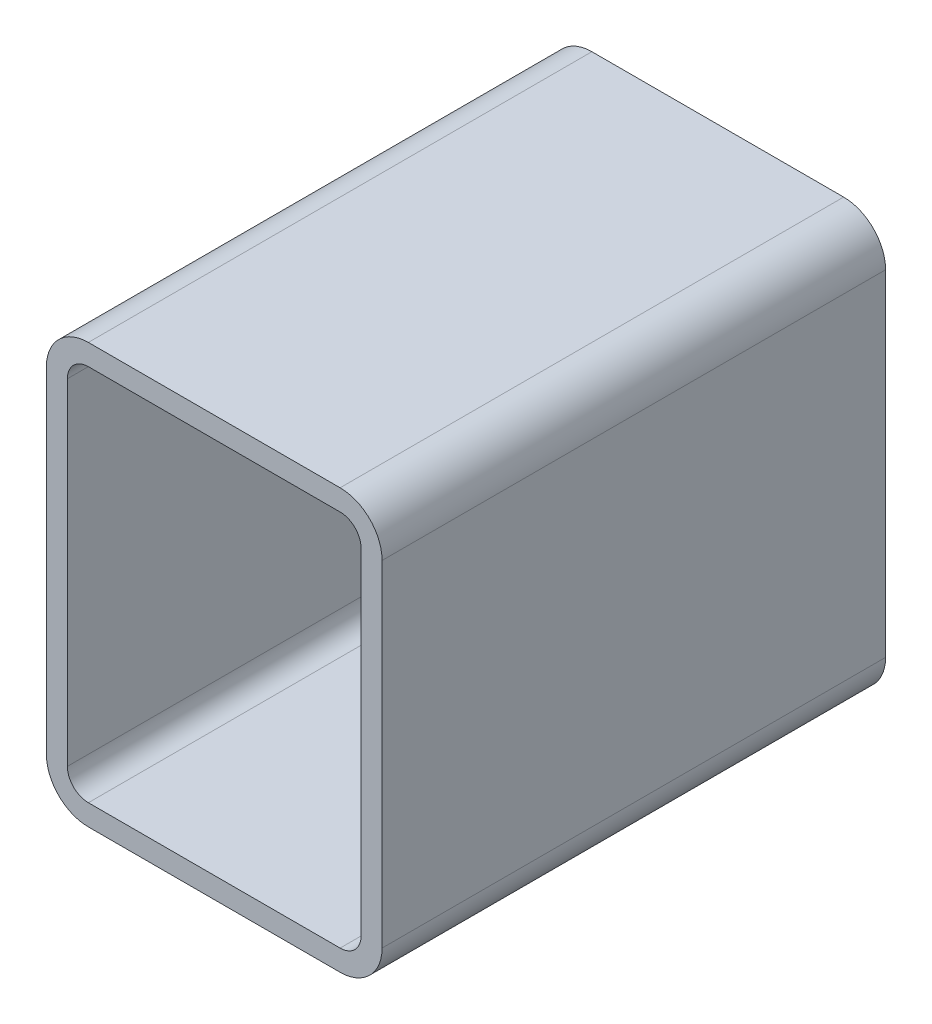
ISO-10303-21;
HEADER;
FILE_DESCRIPTION(('STEP AP214'),'2;1');
FILE_NAME('part.step','',(''),(''),'','','');
FILE_SCHEMA(('AUTOMOTIVE_DESIGN { 1 0 10303 214 1 1 1 1 }'));
ENDSEC;
DATA;
#1=APPLICATION_CONTEXT('core data for automotive mechanical design processes');
#2=APPLICATION_PROTOCOL_DEFINITION('international standard','automotive_design',2000,#1);
#3=PRODUCT_CONTEXT('',#1,'mechanical');
#4=PRODUCT('Part','Part','',(#3));
#5=PRODUCT_RELATED_PRODUCT_CATEGORY('part','',(#4));
#6=PRODUCT_DEFINITION_FORMATION('','',#4);
#7=PRODUCT_DEFINITION_CONTEXT('part definition',#1,'design');
#8=PRODUCT_DEFINITION('design','',#6,#7);
#9=PRODUCT_DEFINITION_SHAPE('','',#8);
#10=(LENGTH_UNIT() NAMED_UNIT(*) SI_UNIT(.MILLI.,.METRE.));
#11=(NAMED_UNIT(*) PLANE_ANGLE_UNIT() SI_UNIT($,.RADIAN.));
#12=(NAMED_UNIT(*) SI_UNIT($,.STERADIAN.) SOLID_ANGLE_UNIT());
#13=UNCERTAINTY_MEASURE_WITH_UNIT(LENGTH_MEASURE(1.E-05),#10,'distance_accuracy_value','');
#14=(GEOMETRIC_REPRESENTATION_CONTEXT(3) GLOBAL_UNCERTAINTY_ASSIGNED_CONTEXT((#13)) GLOBAL_UNIT_ASSIGNED_CONTEXT((#10,
#11,#12)) REPRESENTATION_CONTEXT('',''));
#15=CARTESIAN_POINT('',(0.,0.,0.));
#16=DIRECTION('',(0.,0.,1.));
#17=DIRECTION('',(1.,0.,0.));
#18=AXIS2_PLACEMENT_3D('',#15,#16,#17);
#19=CARTESIAN_POINT('',(179.190940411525,230.520313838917,304.8));
#20=DIRECTION('',(0.,0.,1.));
#21=DIRECTION('',(1.,0.,0.));
#22=AXIS2_PLACEMENT_3D('',#19,#20,#21);
#23=PLANE('',#22);
#24=CARTESIAN_POINT('',(179.190940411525,230.520313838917,304.8));
#25=DIRECTION('',(0.,0.,1.));
#26=DIRECTION('',(1.,0.,0.));
#27=AXIS2_PLACEMENT_3D('',#24,#25,#26);
#28=CIRCLE('',#27,25.4);
#29=CARTESIAN_POINT('',(204.590940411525,230.520313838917,304.8));
#30=VERTEX_POINT('',#29);
#31=CARTESIAN_POINT('',(179.190940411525,255.920313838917,304.8));
#32=VERTEX_POINT('',#31);
#33=EDGE_CURVE('E211',#30,#32,#28,.T.);
#34=ORIENTED_EDGE('',*,*,#33,.T.);
#35=DIRECTION('',(-1.,0.,0.));
#36=VECTOR('',#35,1.);
#37=CARTESIAN_POINT('',(26.7909404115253,255.920313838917,304.8));
#38=LINE('',#37,#36);
#39=CARTESIAN_POINT('',(26.7909404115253,255.920313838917,304.8));
#40=VERTEX_POINT('',#39);
#41=EDGE_CURVE('E214',#32,#40,#38,.T.);
#42=ORIENTED_EDGE('',*,*,#41,.T.);
#43=CARTESIAN_POINT('',(26.7909404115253,230.520313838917,304.8));
#44=DIRECTION('',(0.,0.,1.));
#45=DIRECTION('',(1.,0.,0.));
#46=AXIS2_PLACEMENT_3D('',#43,#44,#45);
#47=CIRCLE('',#46,25.4);
#48=CARTESIAN_POINT('',(1.3909404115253,230.520313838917,304.8));
#49=VERTEX_POINT('',#48);
#50=EDGE_CURVE('E217',#40,#49,#47,.T.);
#51=ORIENTED_EDGE('',*,*,#50,.T.);
#52=DIRECTION('',(0.,-1.,0.));
#53=VECTOR('',#52,1.);
#54=CARTESIAN_POINT('',(1.3909404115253,27.3203138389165,304.8));
#55=LINE('',#54,#53);
#56=CARTESIAN_POINT('',(1.3909404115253,27.3203138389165,304.8));
#57=VERTEX_POINT('',#56);
#58=EDGE_CURVE('E219',#49,#57,#55,.T.);
#59=ORIENTED_EDGE('',*,*,#58,.T.);
#60=CARTESIAN_POINT('',(26.7909404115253,27.3203138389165,304.8));
#61=DIRECTION('',(0.,0.,1.));
#62=DIRECTION('',(1.,0.,0.));
#63=AXIS2_PLACEMENT_3D('',#60,#61,#62);
#64=CIRCLE('',#63,25.4);
#65=CARTESIAN_POINT('',(26.7909404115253,1.92031383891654,304.8));
#66=VERTEX_POINT('',#65);
#67=EDGE_CURVE('E221',#57,#66,#64,.T.);
#68=ORIENTED_EDGE('',*,*,#67,.T.);
#69=DIRECTION('',(1.,0.,0.));
#70=VECTOR('',#69,1.);
#71=CARTESIAN_POINT('',(179.190940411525,1.92031383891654,304.8));
#72=LINE('',#71,#70);
#73=CARTESIAN_POINT('',(179.190940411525,1.92031383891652,304.8));
#74=VERTEX_POINT('',#73);
#75=EDGE_CURVE('E223',#66,#74,#72,.T.);
#76=ORIENTED_EDGE('',*,*,#75,.T.);
#77=CARTESIAN_POINT('',(179.190940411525,27.3203138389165,304.8));
#78=DIRECTION('',(0.,0.,1.));
#79=DIRECTION('',(1.,0.,0.));
#80=AXIS2_PLACEMENT_3D('',#77,#78,#79);
#81=CIRCLE('',#80,25.4);
#82=CARTESIAN_POINT('',(204.590940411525,27.3203138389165,304.8));
#83=VERTEX_POINT('',#82);
#84=EDGE_CURVE('E225',#74,#83,#81,.T.);
#85=ORIENTED_EDGE('',*,*,#84,.T.);
#86=DIRECTION('',(0.,1.,0.));
#87=VECTOR('',#86,1.);
#88=CARTESIAN_POINT('',(204.590940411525,230.520313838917,304.8));
#89=LINE('',#88,#87);
#90=EDGE_CURVE('E227',#83,#30,#89,.T.);
#91=ORIENTED_EDGE('',*,*,#90,.T.);
#92=EDGE_LOOP('',(#34,#42,#51,#59,#68,#76,#85,#91));
#93=FACE_BOUND('',#92,.T.);
#94=DIRECTION('',(0.,-1.,0.));
#95=VECTOR('',#94,1.);
#96=CARTESIAN_POINT('',(14.0909404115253,27.3203138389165,304.8));
#97=LINE('',#96,#95);
#98=CARTESIAN_POINT('',(14.0909404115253,230.520313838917,304.8));
#99=VERTEX_POINT('',#98);
#100=CARTESIAN_POINT('',(14.0909404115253,27.3203138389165,304.8));
#101=VERTEX_POINT('',#100);
#102=EDGE_CURVE('E154',#99,#101,#97,.T.);
#103=ORIENTED_EDGE('',*,*,#102,.F.);
#104=CARTESIAN_POINT('',(26.7909404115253,230.520313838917,304.8));
#105=DIRECTION('',(0.,0.,1.));
#106=DIRECTION('',(1.,0.,0.));
#107=AXIS2_PLACEMENT_3D('',#104,#105,#106);
#108=CIRCLE('',#107,12.7);
#109=CARTESIAN_POINT('',(26.7909404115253,243.220313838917,304.8));
#110=VERTEX_POINT('',#109);
#111=EDGE_CURVE('E146',#110,#99,#108,.T.);
#112=ORIENTED_EDGE('',*,*,#111,.F.);
#113=DIRECTION('',(-1.,0.,0.));
#114=VECTOR('',#113,1.);
#115=CARTESIAN_POINT('',(26.7909404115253,243.220313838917,304.8));
#116=LINE('',#115,#114);
#117=CARTESIAN_POINT('',(179.190940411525,243.220313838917,304.8));
#118=VERTEX_POINT('',#117);
#119=EDGE_CURVE('E179',#118,#110,#116,.T.);
#120=ORIENTED_EDGE('',*,*,#119,.F.);
#121=CARTESIAN_POINT('',(179.190940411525,230.520313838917,304.8));
#122=DIRECTION('',(0.,0.,1.));
#123=DIRECTION('',(1.,0.,0.));
#124=AXIS2_PLACEMENT_3D('',#121,#122,#123);
#125=CIRCLE('',#124,12.7);
#126=CARTESIAN_POINT('',(191.890940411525,230.520313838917,304.8));
#127=VERTEX_POINT('',#126);
#128=EDGE_CURVE('E177',#127,#118,#125,.T.);
#129=ORIENTED_EDGE('',*,*,#128,.F.);
#130=DIRECTION('',(0.,1.,0.));
#131=VECTOR('',#130,1.);
#132=CARTESIAN_POINT('',(191.890940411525,230.520313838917,304.8));
#133=LINE('',#132,#131);
#134=CARTESIAN_POINT('',(191.890940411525,27.3203138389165,304.8));
#135=VERTEX_POINT('',#134);
#136=EDGE_CURVE('E175',#135,#127,#133,.T.);
#137=ORIENTED_EDGE('',*,*,#136,.F.);
#138=CARTESIAN_POINT('',(179.190940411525,27.3203138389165,304.8));
#139=DIRECTION('',(0.,0.,1.));
#140=DIRECTION('',(1.,0.,0.));
#141=AXIS2_PLACEMENT_3D('',#138,#139,#140);
#142=CIRCLE('',#141,12.7);
#143=CARTESIAN_POINT('',(179.190940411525,14.6203138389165,304.8));
#144=VERTEX_POINT('',#143);
#145=EDGE_CURVE('E173',#144,#135,#142,.T.);
#146=ORIENTED_EDGE('',*,*,#145,.F.);
#147=DIRECTION('',(1.,0.,0.));
#148=VECTOR('',#147,1.);
#149=CARTESIAN_POINT('',(179.190940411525,14.6203138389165,304.8));
#150=LINE('',#149,#148);
#151=CARTESIAN_POINT('',(26.7909404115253,14.6203138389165,304.8));
#152=VERTEX_POINT('',#151);
#153=EDGE_CURVE('E169',#152,#144,#150,.T.);
#154=ORIENTED_EDGE('',*,*,#153,.F.);
#155=CARTESIAN_POINT('',(26.7909404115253,27.3203138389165,304.8));
#156=DIRECTION('',(0.,0.,1.));
#157=DIRECTION('',(1.,0.,0.));
#158=AXIS2_PLACEMENT_3D('',#155,#156,#157);
#159=CIRCLE('',#158,12.7);
#160=EDGE_CURVE('E167',#101,#152,#159,.T.);
#161=ORIENTED_EDGE('',*,*,#160,.F.);
#162=EDGE_LOOP('',(#103,#112,#120,#129,#137,#146,#154,#161));
#163=FACE_BOUND('',#162,.T.);
#164=ADVANCED_FACE('F33',(#93,#163),#23,.T.);
#165=CARTESIAN_POINT('',(179.190940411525,230.520313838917,0.));
#166=DIRECTION('',(0.,0.,1.));
#167=DIRECTION('',(1.,0.,0.));
#168=AXIS2_PLACEMENT_3D('',#165,#166,#167);
#169=PLANE('',#168);
#170=CARTESIAN_POINT('',(179.190940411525,230.520313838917,0.));
#171=DIRECTION('',(0.,0.,1.));
#172=DIRECTION('',(1.,0.,0.));
#173=AXIS2_PLACEMENT_3D('',#170,#171,#172);
#174=CIRCLE('',#173,25.4);
#175=CARTESIAN_POINT('',(204.590940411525,230.520313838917,0.));
#176=VERTEX_POINT('',#175);
#177=CARTESIAN_POINT('',(179.190940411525,255.920313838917,0.));
#178=VERTEX_POINT('',#177);
#179=EDGE_CURVE('E162',#176,#178,#174,.T.);
#180=ORIENTED_EDGE('',*,*,#179,.F.);
#181=DIRECTION('',(0.,1.,0.));
#182=VECTOR('',#181,1.);
#183=CARTESIAN_POINT('',(204.590940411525,230.520313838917,0.));
#184=LINE('',#183,#182);
#185=CARTESIAN_POINT('',(204.590940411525,27.3203138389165,0.));
#186=VERTEX_POINT('',#185);
#187=EDGE_CURVE('E215',#186,#176,#184,.T.);
#188=ORIENTED_EDGE('',*,*,#187,.F.);
#189=CARTESIAN_POINT('',(179.190940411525,27.3203138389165,0.));
#190=DIRECTION('',(0.,0.,1.));
#191=DIRECTION('',(1.,0.,0.));
#192=AXIS2_PLACEMENT_3D('',#189,#190,#191);
#193=CIRCLE('',#192,25.4);
#194=CARTESIAN_POINT('',(179.190940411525,1.92031383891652,0.));
#195=VERTEX_POINT('',#194);
#196=EDGE_CURVE('E242',#195,#186,#193,.T.);
#197=ORIENTED_EDGE('',*,*,#196,.F.);
#198=DIRECTION('',(1.,0.,0.));
#199=VECTOR('',#198,1.);
#200=CARTESIAN_POINT('',(179.190940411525,1.92031383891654,0.));
#201=LINE('',#200,#199);
#202=CARTESIAN_POINT('',(26.7909404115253,1.92031383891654,0.));
#203=VERTEX_POINT('',#202);
#204=EDGE_CURVE('E240',#203,#195,#201,.T.);
#205=ORIENTED_EDGE('',*,*,#204,.F.);
#206=CARTESIAN_POINT('',(26.7909404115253,27.3203138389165,0.));
#207=DIRECTION('',(0.,0.,1.));
#208=DIRECTION('',(1.,0.,0.));
#209=AXIS2_PLACEMENT_3D('',#206,#207,#208);
#210=CIRCLE('',#209,25.4);
#211=CARTESIAN_POINT('',(1.3909404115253,27.3203138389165,0.));
#212=VERTEX_POINT('',#211);
#213=EDGE_CURVE('E238',#212,#203,#210,.T.);
#214=ORIENTED_EDGE('',*,*,#213,.F.);
#215=DIRECTION('',(0.,-1.,0.));
#216=VECTOR('',#215,1.);
#217=CARTESIAN_POINT('',(1.3909404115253,27.3203138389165,0.));
#218=LINE('',#217,#216);
#219=CARTESIAN_POINT('',(1.3909404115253,230.520313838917,0.));
#220=VERTEX_POINT('',#219);
#221=EDGE_CURVE('E236',#220,#212,#218,.T.);
#222=ORIENTED_EDGE('',*,*,#221,.F.);
#223=CARTESIAN_POINT('',(26.7909404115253,230.520313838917,0.));
#224=DIRECTION('',(0.,0.,1.));
#225=DIRECTION('',(1.,0.,0.));
#226=AXIS2_PLACEMENT_3D('',#223,#224,#225);
#227=CIRCLE('',#226,25.4);
#228=CARTESIAN_POINT('',(26.7909404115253,255.920313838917,0.));
#229=VERTEX_POINT('',#228);
#230=EDGE_CURVE('E234',#229,#220,#227,.T.);
#231=ORIENTED_EDGE('',*,*,#230,.F.);
#232=DIRECTION('',(-1.,0.,0.));
#233=VECTOR('',#232,1.);
#234=CARTESIAN_POINT('',(26.7909404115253,255.920313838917,0.));
#235=LINE('',#234,#233);
#236=EDGE_CURVE('E232',#178,#229,#235,.T.);
#237=ORIENTED_EDGE('',*,*,#236,.F.);
#238=EDGE_LOOP('',(#180,#188,#197,#205,#214,#222,#231,#237));
#239=FACE_BOUND('',#238,.T.);
#240=CARTESIAN_POINT('',(26.7909404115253,230.520313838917,0.));
#241=DIRECTION('',(0.,0.,1.));
#242=DIRECTION('',(1.,0.,0.));
#243=AXIS2_PLACEMENT_3D('',#240,#241,#242);
#244=CIRCLE('',#243,12.7);
#245=CARTESIAN_POINT('',(26.7909404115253,243.220313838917,0.));
#246=VERTEX_POINT('',#245);
#247=CARTESIAN_POINT('',(14.0909404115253,230.520313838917,0.));
#248=VERTEX_POINT('',#247);
#249=EDGE_CURVE('E56',#246,#248,#244,.T.);
#250=ORIENTED_EDGE('',*,*,#249,.T.);
#251=DIRECTION('',(0.,-1.,0.));
#252=VECTOR('',#251,1.);
#253=CARTESIAN_POINT('',(14.0909404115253,27.3203138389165,0.));
#254=LINE('',#253,#252);
#255=CARTESIAN_POINT('',(14.0909404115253,27.3203138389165,0.));
#256=VERTEX_POINT('',#255);
#257=EDGE_CURVE('E161',#248,#256,#254,.T.);
#258=ORIENTED_EDGE('',*,*,#257,.T.);
#259=CARTESIAN_POINT('',(26.7909404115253,27.3203138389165,0.));
#260=DIRECTION('',(0.,0.,1.));
#261=DIRECTION('',(1.,0.,0.));
#262=AXIS2_PLACEMENT_3D('',#259,#260,#261);
#263=CIRCLE('',#262,12.7);
#264=CARTESIAN_POINT('',(26.7909404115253,14.6203138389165,0.));
#265=VERTEX_POINT('',#264);
#266=EDGE_CURVE('E183',#256,#265,#263,.T.);
#267=ORIENTED_EDGE('',*,*,#266,.T.);
#268=DIRECTION('',(1.,0.,0.));
#269=VECTOR('',#268,1.);
#270=CARTESIAN_POINT('',(179.190940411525,14.6203138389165,0.));
#271=LINE('',#270,#269);
#272=CARTESIAN_POINT('',(179.190940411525,14.6203138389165,0.));
#273=VERTEX_POINT('',#272);
#274=EDGE_CURVE('E186',#265,#273,#271,.T.);
#275=ORIENTED_EDGE('',*,*,#274,.T.);
#276=CARTESIAN_POINT('',(179.190940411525,27.3203138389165,0.));
#277=DIRECTION('',(0.,0.,1.));
#278=DIRECTION('',(1.,0.,0.));
#279=AXIS2_PLACEMENT_3D('',#276,#277,#278);
#280=CIRCLE('',#279,12.7);
#281=CARTESIAN_POINT('',(191.890940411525,27.3203138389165,0.));
#282=VERTEX_POINT('',#281);
#283=EDGE_CURVE('E189',#273,#282,#280,.T.);
#284=ORIENTED_EDGE('',*,*,#283,.T.);
#285=DIRECTION('',(0.,1.,0.));
#286=VECTOR('',#285,1.);
#287=CARTESIAN_POINT('',(191.890940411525,230.520313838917,0.));
#288=LINE('',#287,#286);
#289=CARTESIAN_POINT('',(191.890940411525,230.520313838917,0.));
#290=VERTEX_POINT('',#289);
#291=EDGE_CURVE('E192',#282,#290,#288,.T.);
#292=ORIENTED_EDGE('',*,*,#291,.T.);
#293=CARTESIAN_POINT('',(179.190940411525,230.520313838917,0.));
#294=DIRECTION('',(0.,0.,1.));
#295=DIRECTION('',(1.,0.,0.));
#296=AXIS2_PLACEMENT_3D('',#293,#294,#295);
#297=CIRCLE('',#296,12.7);
#298=CARTESIAN_POINT('',(179.190940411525,243.220313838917,0.));
#299=VERTEX_POINT('',#298);
#300=EDGE_CURVE('E195',#290,#299,#297,.T.);
#301=ORIENTED_EDGE('',*,*,#300,.T.);
#302=DIRECTION('',(-1.,0.,0.));
#303=VECTOR('',#302,1.);
#304=CARTESIAN_POINT('',(26.7909404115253,243.220313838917,0.));
#305=LINE('',#304,#303);
#306=EDGE_CURVE('E155',#299,#246,#305,.T.);
#307=ORIENTED_EDGE('',*,*,#306,.T.);
#308=EDGE_LOOP('',(#250,#258,#267,#275,#284,#292,#301,#307));
#309=FACE_BOUND('',#308,.T.);
#310=ADVANCED_FACE('F272',(#239,#309),#169,.F.);
#311=CARTESIAN_POINT('',(179.190940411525,230.520313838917,304.8));
#312=DIRECTION('',(0.,0.,-1.));
#313=DIRECTION('',(-1.,0.,0.));
#314=AXIS2_PLACEMENT_3D('',#311,#312,#313);
#315=CYLINDRICAL_SURFACE('',#314,25.4);
#316=ORIENTED_EDGE('',*,*,#179,.T.);
#317=DIRECTION('',(0.,0.,-1.));
#318=VECTOR('',#317,1.);
#319=CARTESIAN_POINT('',(179.190940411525,255.920313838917,304.8));
#320=LINE('',#319,#318);
#321=EDGE_CURVE('E11',#32,#178,#320,.T.);
#322=ORIENTED_EDGE('',*,*,#321,.F.);
#323=ORIENTED_EDGE('',*,*,#33,.F.);
#324=DIRECTION('',(0.,0.,-1.));
#325=VECTOR('',#324,1.);
#326=CARTESIAN_POINT('',(204.590940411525,230.520313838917,304.8));
#327=LINE('',#326,#325);
#328=EDGE_CURVE('E229',#30,#176,#327,.T.);
#329=ORIENTED_EDGE('',*,*,#328,.T.);
#330=EDGE_LOOP('',(#316,#322,#323,#329));
#331=FACE_BOUND('',#330,.T.);
#332=ADVANCED_FACE('F35',(#331),#315,.T.);
#333=CARTESIAN_POINT('',(26.7909404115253,255.920313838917,304.8));
#334=DIRECTION('',(0.,-1.,0.));
#335=DIRECTION('',(0.,0.,-1.));
#336=AXIS2_PLACEMENT_3D('',#333,#334,#335);
#337=PLANE('',#336);
#338=ORIENTED_EDGE('',*,*,#236,.T.);
#339=DIRECTION('',(0.,0.,-1.));
#340=VECTOR('',#339,1.);
#341=CARTESIAN_POINT('',(26.7909404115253,255.920313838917,304.8));
#342=LINE('',#341,#340);
#343=EDGE_CURVE('E41',#40,#229,#342,.T.);
#344=ORIENTED_EDGE('',*,*,#343,.F.);
#345=ORIENTED_EDGE('',*,*,#41,.F.);
#346=ORIENTED_EDGE('',*,*,#321,.T.);
#347=EDGE_LOOP('',(#338,#344,#345,#346));
#348=FACE_BOUND('',#347,.T.);
#349=ADVANCED_FACE('F289',(#348),#337,.F.);
#350=CARTESIAN_POINT('',(26.7909404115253,230.520313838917,304.8));
#351=DIRECTION('',(0.,0.,-1.));
#352=DIRECTION('',(-1.,0.,0.));
#353=AXIS2_PLACEMENT_3D('',#350,#351,#352);
#354=CYLINDRICAL_SURFACE('',#353,25.4);
#355=ORIENTED_EDGE('',*,*,#230,.T.);
#356=DIRECTION('',(0.,0.,-1.));
#357=VECTOR('',#356,1.);
#358=CARTESIAN_POINT('',(1.3909404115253,230.520313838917,304.8));
#359=LINE('',#358,#357);
#360=EDGE_CURVE('E259',#49,#220,#359,.T.);
#361=ORIENTED_EDGE('',*,*,#360,.F.);
#362=ORIENTED_EDGE('',*,*,#50,.F.);
#363=ORIENTED_EDGE('',*,*,#343,.T.);
#364=EDGE_LOOP('',(#355,#361,#362,#363));
#365=FACE_BOUND('',#364,.T.);
#366=ADVANCED_FACE('F266',(#365),#354,.T.);
#367=CARTESIAN_POINT('',(1.3909404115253,27.3203138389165,304.8));
#368=DIRECTION('',(1.,0.,0.));
#369=DIRECTION('',(0.,0.,-1.));
#370=AXIS2_PLACEMENT_3D('',#367,#368,#369);
#371=PLANE('',#370);
#372=ORIENTED_EDGE('',*,*,#221,.T.);
#373=DIRECTION('',(0.,0.,-1.));
#374=VECTOR('',#373,1.);
#375=CARTESIAN_POINT('',(1.3909404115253,27.3203138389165,304.8));
#376=LINE('',#375,#374);
#377=EDGE_CURVE('E256',#57,#212,#376,.T.);
#378=ORIENTED_EDGE('',*,*,#377,.F.);
#379=ORIENTED_EDGE('',*,*,#58,.F.);
#380=ORIENTED_EDGE('',*,*,#360,.T.);
#381=EDGE_LOOP('',(#372,#378,#379,#380));
#382=FACE_BOUND('',#381,.T.);
#383=ADVANCED_FACE('F278',(#382),#371,.F.);
#384=CARTESIAN_POINT('',(26.7909404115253,27.3203138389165,304.8));
#385=DIRECTION('',(0.,0.,-1.));
#386=DIRECTION('',(-1.,0.,0.));
#387=AXIS2_PLACEMENT_3D('',#384,#385,#386);
#388=CYLINDRICAL_SURFACE('',#387,25.4);
#389=ORIENTED_EDGE('',*,*,#213,.T.);
#390=DIRECTION('',(0.,0.,-1.));
#391=VECTOR('',#390,1.);
#392=CARTESIAN_POINT('',(26.7909404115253,1.92031383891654,304.8));
#393=LINE('',#392,#391);
#394=EDGE_CURVE('E253',#66,#203,#393,.T.);
#395=ORIENTED_EDGE('',*,*,#394,.F.);
#396=ORIENTED_EDGE('',*,*,#67,.F.);
#397=ORIENTED_EDGE('',*,*,#377,.T.);
#398=EDGE_LOOP('',(#389,#395,#396,#397));
#399=FACE_BOUND('',#398,.T.);
#400=ADVANCED_FACE('F282',(#399),#388,.T.);
#401=CARTESIAN_POINT('',(179.190940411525,1.92031383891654,304.8));
#402=DIRECTION('',(0.,1.,0.));
#403=DIRECTION('',(0.,0.,1.));
#404=AXIS2_PLACEMENT_3D('',#401,#402,#403);
#405=PLANE('',#404);
#406=ORIENTED_EDGE('',*,*,#204,.T.);
#407=DIRECTION('',(0.,0.,-1.));
#408=VECTOR('',#407,1.);
#409=CARTESIAN_POINT('',(179.190940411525,1.92031383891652,304.8));
#410=LINE('',#409,#408);
#411=EDGE_CURVE('E250',#74,#195,#410,.T.);
#412=ORIENTED_EDGE('',*,*,#411,.F.);
#413=ORIENTED_EDGE('',*,*,#75,.F.);
#414=ORIENTED_EDGE('',*,*,#394,.T.);
#415=EDGE_LOOP('',(#406,#412,#413,#414));
#416=FACE_BOUND('',#415,.T.);
#417=ADVANCED_FACE('F302',(#416),#405,.F.);
#418=CARTESIAN_POINT('',(179.190940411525,27.3203138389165,304.8));
#419=DIRECTION('',(0.,0.,-1.));
#420=DIRECTION('',(-1.,0.,0.));
#421=AXIS2_PLACEMENT_3D('',#418,#419,#420);
#422=CYLINDRICAL_SURFACE('',#421,25.4);
#423=ORIENTED_EDGE('',*,*,#196,.T.);
#424=DIRECTION('',(0.,0.,-1.));
#425=VECTOR('',#424,1.);
#426=CARTESIAN_POINT('',(204.590940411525,27.3203138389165,304.8));
#427=LINE('',#426,#425);
#428=EDGE_CURVE('E247',#83,#186,#427,.T.);
#429=ORIENTED_EDGE('',*,*,#428,.F.);
#430=ORIENTED_EDGE('',*,*,#84,.F.);
#431=ORIENTED_EDGE('',*,*,#411,.T.);
#432=EDGE_LOOP('',(#423,#429,#430,#431));
#433=FACE_BOUND('',#432,.T.);
#434=ADVANCED_FACE('F300',(#433),#422,.T.);
#435=CARTESIAN_POINT('',(204.590940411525,230.520313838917,304.8));
#436=DIRECTION('',(-1.,0.,0.));
#437=DIRECTION('',(0.,0.,1.));
#438=AXIS2_PLACEMENT_3D('',#435,#436,#437);
#439=PLANE('',#438);
#440=ORIENTED_EDGE('',*,*,#187,.T.);
#441=ORIENTED_EDGE('',*,*,#328,.F.);
#442=ORIENTED_EDGE('',*,*,#90,.F.);
#443=ORIENTED_EDGE('',*,*,#428,.T.);
#444=EDGE_LOOP('',(#440,#441,#442,#443));
#445=FACE_BOUND('',#444,.T.);
#446=ADVANCED_FACE('F295',(#445),#439,.F.);
#447=CARTESIAN_POINT('',(26.7909404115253,230.520313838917,304.8));
#448=DIRECTION('',(0.,0.,-1.));
#449=DIRECTION('',(-1.,0.,0.));
#450=AXIS2_PLACEMENT_3D('',#447,#448,#449);
#451=CYLINDRICAL_SURFACE('',#450,12.7);
#452=ORIENTED_EDGE('',*,*,#249,.F.);
#453=DIRECTION('',(0.,0.,-1.));
#454=VECTOR('',#453,1.);
#455=CARTESIAN_POINT('',(26.7909404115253,243.220313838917,304.8));
#456=LINE('',#455,#454);
#457=EDGE_CURVE('E150',#110,#246,#456,.T.);
#458=ORIENTED_EDGE('',*,*,#457,.F.);
#459=ORIENTED_EDGE('',*,*,#111,.T.);
#460=DIRECTION('',(0.,0.,-1.));
#461=VECTOR('',#460,1.);
#462=CARTESIAN_POINT('',(14.0909404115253,230.520313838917,304.8));
#463=LINE('',#462,#461);
#464=EDGE_CURVE('E149',#99,#248,#463,.T.);
#465=ORIENTED_EDGE('',*,*,#464,.T.);
#466=EDGE_LOOP('',(#452,#458,#459,#465));
#467=FACE_BOUND('',#466,.T.);
#468=ADVANCED_FACE('F148',(#467),#451,.F.);
#469=CARTESIAN_POINT('',(14.0909404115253,27.3203138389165,304.8));
#470=DIRECTION('',(1.,0.,0.));
#471=DIRECTION('',(0.,0.,-1.));
#472=AXIS2_PLACEMENT_3D('',#469,#470,#471);
#473=PLANE('',#472);
#474=ORIENTED_EDGE('',*,*,#257,.F.);
#475=ORIENTED_EDGE('',*,*,#464,.F.);
#476=ORIENTED_EDGE('',*,*,#102,.T.);
#477=DIRECTION('',(0.,0.,-1.));
#478=VECTOR('',#477,1.);
#479=CARTESIAN_POINT('',(14.0909404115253,27.3203138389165,304.8));
#480=LINE('',#479,#478);
#481=EDGE_CURVE('E163',#101,#256,#480,.T.);
#482=ORIENTED_EDGE('',*,*,#481,.T.);
#483=EDGE_LOOP('',(#474,#475,#476,#482));
#484=FACE_BOUND('',#483,.T.);
#485=ADVANCED_FACE('F158',(#484),#473,.T.);
#486=CARTESIAN_POINT('',(26.7909404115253,27.3203138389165,304.8));
#487=DIRECTION('',(0.,0.,-1.));
#488=DIRECTION('',(-1.,0.,0.));
#489=AXIS2_PLACEMENT_3D('',#486,#487,#488);
#490=CYLINDRICAL_SURFACE('',#489,12.7);
#491=ORIENTED_EDGE('',*,*,#266,.F.);
#492=ORIENTED_EDGE('',*,*,#481,.F.);
#493=ORIENTED_EDGE('',*,*,#160,.T.);
#494=DIRECTION('',(0.,0.,-1.));
#495=VECTOR('',#494,1.);
#496=CARTESIAN_POINT('',(26.7909404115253,14.6203138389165,304.8));
#497=LINE('',#496,#495);
#498=EDGE_CURVE('E208',#152,#265,#497,.T.);
#499=ORIENTED_EDGE('',*,*,#498,.T.);
#500=EDGE_LOOP('',(#491,#492,#493,#499));
#501=FACE_BOUND('',#500,.T.);
#502=ADVANCED_FACE('F327',(#501),#490,.F.);
#503=CARTESIAN_POINT('',(179.190940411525,14.6203138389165,304.8));
#504=DIRECTION('',(0.,1.,0.));
#505=DIRECTION('',(0.,0.,1.));
#506=AXIS2_PLACEMENT_3D('',#503,#504,#505);
#507=PLANE('',#506);
#508=ORIENTED_EDGE('',*,*,#274,.F.);
#509=ORIENTED_EDGE('',*,*,#498,.F.);
#510=ORIENTED_EDGE('',*,*,#153,.T.);
#511=DIRECTION('',(0.,0.,-1.));
#512=VECTOR('',#511,1.);
#513=CARTESIAN_POINT('',(179.190940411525,14.6203138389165,304.8));
#514=LINE('',#513,#512);
#515=EDGE_CURVE('E206',#144,#273,#514,.T.);
#516=ORIENTED_EDGE('',*,*,#515,.T.);
#517=EDGE_LOOP('',(#508,#509,#510,#516));
#518=FACE_BOUND('',#517,.T.);
#519=ADVANCED_FACE('F331',(#518),#507,.T.);
#520=CARTESIAN_POINT('',(179.190940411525,27.3203138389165,304.8));
#521=DIRECTION('',(0.,0.,-1.));
#522=DIRECTION('',(-1.,0.,0.));
#523=AXIS2_PLACEMENT_3D('',#520,#521,#522);
#524=CYLINDRICAL_SURFACE('',#523,12.7);
#525=ORIENTED_EDGE('',*,*,#283,.F.);
#526=ORIENTED_EDGE('',*,*,#515,.F.);
#527=ORIENTED_EDGE('',*,*,#145,.T.);
#528=DIRECTION('',(0.,0.,-1.));
#529=VECTOR('',#528,1.);
#530=CARTESIAN_POINT('',(191.890940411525,27.3203138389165,304.8));
#531=LINE('',#530,#529);
#532=EDGE_CURVE('E204',#135,#282,#531,.T.);
#533=ORIENTED_EDGE('',*,*,#532,.T.);
#534=EDGE_LOOP('',(#525,#526,#527,#533));
#535=FACE_BOUND('',#534,.T.);
#536=ADVANCED_FACE('F337',(#535),#524,.F.);
#537=CARTESIAN_POINT('',(191.890940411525,230.520313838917,304.8));
#538=DIRECTION('',(-1.,0.,0.));
#539=DIRECTION('',(0.,0.,1.));
#540=AXIS2_PLACEMENT_3D('',#537,#538,#539);
#541=PLANE('',#540);
#542=ORIENTED_EDGE('',*,*,#291,.F.);
#543=ORIENTED_EDGE('',*,*,#532,.F.);
#544=ORIENTED_EDGE('',*,*,#136,.T.);
#545=DIRECTION('',(0.,0.,-1.));
#546=VECTOR('',#545,1.);
#547=CARTESIAN_POINT('',(191.890940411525,230.520313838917,304.8));
#548=LINE('',#547,#546);
#549=EDGE_CURVE('E202',#127,#290,#548,.T.);
#550=ORIENTED_EDGE('',*,*,#549,.T.);
#551=EDGE_LOOP('',(#542,#543,#544,#550));
#552=FACE_BOUND('',#551,.T.);
#553=ADVANCED_FACE('F341',(#552),#541,.T.);
#554=CARTESIAN_POINT('',(179.190940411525,230.520313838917,304.8));
#555=DIRECTION('',(0.,0.,-1.));
#556=DIRECTION('',(-1.,0.,0.));
#557=AXIS2_PLACEMENT_3D('',#554,#555,#556);
#558=CYLINDRICAL_SURFACE('',#557,12.7);
#559=ORIENTED_EDGE('',*,*,#300,.F.);
#560=ORIENTED_EDGE('',*,*,#549,.F.);
#561=ORIENTED_EDGE('',*,*,#128,.T.);
#562=DIRECTION('',(0.,0.,-1.));
#563=VECTOR('',#562,1.);
#564=CARTESIAN_POINT('',(179.190940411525,243.220313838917,304.8));
#565=LINE('',#564,#563);
#566=EDGE_CURVE('E48',#118,#299,#565,.T.);
#567=ORIENTED_EDGE('',*,*,#566,.T.);
#568=EDGE_LOOP('',(#559,#560,#561,#567));
#569=FACE_BOUND('',#568,.T.);
#570=ADVANCED_FACE('F345',(#569),#558,.F.);
#571=CARTESIAN_POINT('',(26.7909404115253,243.220313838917,304.8));
#572=DIRECTION('',(0.,-1.,0.));
#573=DIRECTION('',(0.,0.,-1.));
#574=AXIS2_PLACEMENT_3D('',#571,#572,#573);
#575=PLANE('',#574);
#576=ORIENTED_EDGE('',*,*,#306,.F.);
#577=ORIENTED_EDGE('',*,*,#566,.F.);
#578=ORIENTED_EDGE('',*,*,#119,.T.);
#579=ORIENTED_EDGE('',*,*,#457,.T.);
#580=EDGE_LOOP('',(#576,#577,#578,#579));
#581=FACE_BOUND('',#580,.T.);
#582=ADVANCED_FACE('F349',(#581),#575,.T.);
#583=CLOSED_SHELL('',(#164,#310,#332,#349,#366,#383,#400,#417,#434,#446,#468,#485,#502,#519,
#536,#553,#570,#582));
#584=MANIFOLD_SOLID_BREP('B2',#583);
#585=ADVANCED_BREP_SHAPE_REPRESENTATION('',(#18,#584),#14);
#586=SHAPE_DEFINITION_REPRESENTATION(#9,#585);
ENDSEC;
END-ISO-10303-21;
